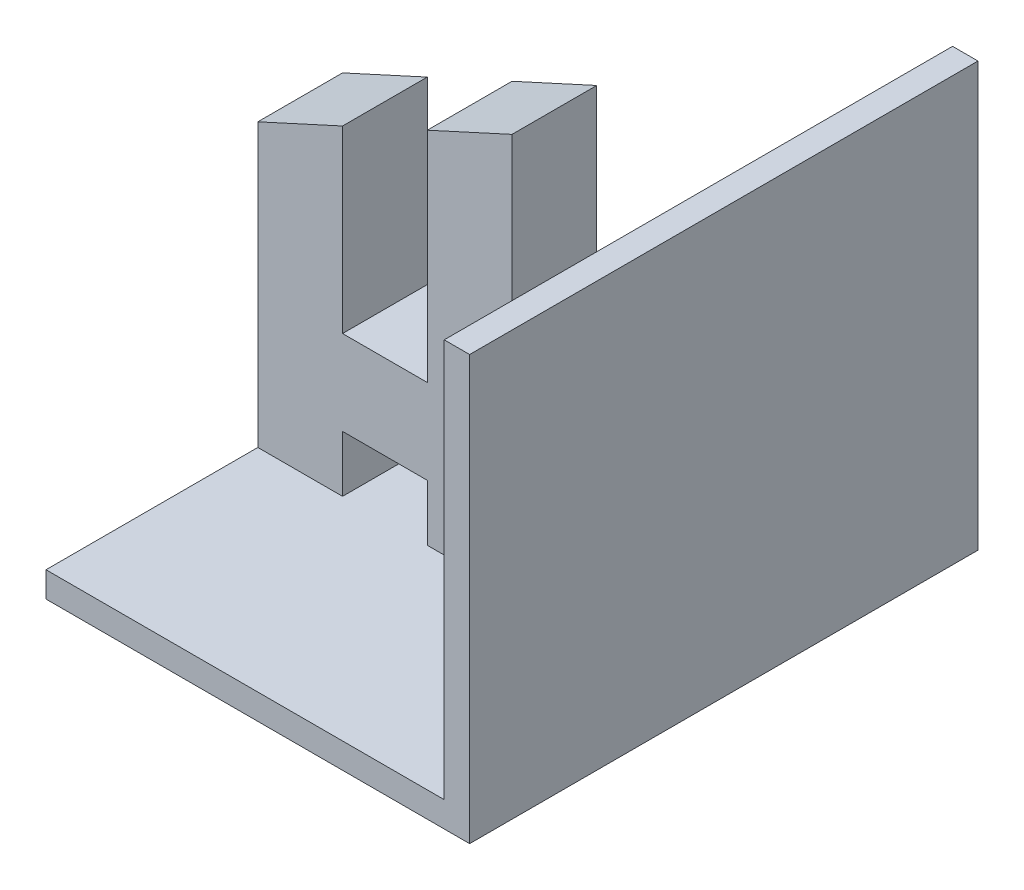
ISO-10303-21;
HEADER;
FILE_DESCRIPTION(('STEP AP214'),'2;1');
FILE_NAME('part.step','',(''),(''),'','','');
FILE_SCHEMA(('AUTOMOTIVE_DESIGN { 1 0 10303 214 1 1 1 1 }'));
ENDSEC;
DATA;
#1=APPLICATION_CONTEXT('core data for automotive mechanical design processes');
#2=APPLICATION_PROTOCOL_DEFINITION('international standard','automotive_design',2000,#1);
#3=PRODUCT_CONTEXT('',#1,'mechanical');
#4=PRODUCT('Part','Part','',(#3));
#5=PRODUCT_RELATED_PRODUCT_CATEGORY('part','',(#4));
#6=PRODUCT_DEFINITION_FORMATION('','',#4);
#7=PRODUCT_DEFINITION_CONTEXT('part definition',#1,'design');
#8=PRODUCT_DEFINITION('design','',#6,#7);
#9=PRODUCT_DEFINITION_SHAPE('','',#8);
#10=(LENGTH_UNIT() NAMED_UNIT(*) SI_UNIT(.MILLI.,.METRE.));
#11=(NAMED_UNIT(*) PLANE_ANGLE_UNIT() SI_UNIT($,.RADIAN.));
#12=(NAMED_UNIT(*) SI_UNIT($,.STERADIAN.) SOLID_ANGLE_UNIT());
#13=UNCERTAINTY_MEASURE_WITH_UNIT(LENGTH_MEASURE(1.E-05),#10,'distance_accuracy_value','');
#14=(GEOMETRIC_REPRESENTATION_CONTEXT(3) GLOBAL_UNCERTAINTY_ASSIGNED_CONTEXT((#13)) GLOBAL_UNIT_ASSIGNED_CONTEXT((#10,
#11,#12)) REPRESENTATION_CONTEXT('',''));
#15=CARTESIAN_POINT('',(0.,0.,0.));
#16=DIRECTION('',(0.,0.,1.));
#17=DIRECTION('',(1.,0.,0.));
#18=AXIS2_PLACEMENT_3D('',#15,#16,#17);
#19=CARTESIAN_POINT('',(-3.,0.,30.));
#20=DIRECTION('',(-1.,0.,0.));
#21=DIRECTION('',(0.,0.,1.));
#22=AXIS2_PLACEMENT_3D('',#19,#20,#21);
#23=PLANE('',#22);
#24=DIRECTION('',(0.,1.,0.));
#25=VECTOR('',#24,1.);
#26=CARTESIAN_POINT('',(-3.,0.,-30.));
#27=LINE('',#26,#25);
#28=CARTESIAN_POINT('',(-3.,3.,-30.));
#29=VERTEX_POINT('',#28);
#30=CARTESIAN_POINT('',(-3.,50.,-30.));
#31=VERTEX_POINT('',#30);
#32=EDGE_CURVE('E314',#29,#31,#27,.T.);
#33=ORIENTED_EDGE('',*,*,#32,.F.);
#34=DIRECTION('',(0.,0.,-1.));
#35=VECTOR('',#34,1.);
#36=CARTESIAN_POINT('',(-3.,3.,30.));
#37=LINE('',#36,#35);
#38=CARTESIAN_POINT('',(-3.,3.,30.));
#39=VERTEX_POINT('',#38);
#40=EDGE_CURVE('E336',#39,#29,#37,.T.);
#41=ORIENTED_EDGE('',*,*,#40,.F.);
#42=DIRECTION('',(0.,1.,0.));
#43=VECTOR('',#42,1.);
#44=CARTESIAN_POINT('',(-3.,0.,30.));
#45=LINE('',#44,#43);
#46=CARTESIAN_POINT('',(-3.,50.,30.));
#47=VERTEX_POINT('',#46);
#48=EDGE_CURVE('E326',#39,#47,#45,.T.);
#49=ORIENTED_EDGE('',*,*,#48,.T.);
#50=DIRECTION('',(0.,0.,-1.));
#51=VECTOR('',#50,1.);
#52=CARTESIAN_POINT('',(-3.,50.,30.));
#53=LINE('',#52,#51);
#54=EDGE_CURVE('E41',#47,#31,#53,.T.);
#55=ORIENTED_EDGE('',*,*,#54,.T.);
#56=EDGE_LOOP('',(#33,#41,#49,#55));
#57=FACE_BOUND('',#56,.T.);
#58=DIRECTION('',(0.,0.,1.));
#59=VECTOR('',#58,1.);
#60=CARTESIAN_POINT('',(-3.,9.64285714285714,-4.9999999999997));
#61=LINE('',#60,#59);
#62=CARTESIAN_POINT('',(-3.,9.64285714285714,-4.9999999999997));
#63=VERTEX_POINT('',#62);
#64=CARTESIAN_POINT('',(-3.,9.64285714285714,4.99999999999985));
#65=VERTEX_POINT('',#64);
#66=EDGE_CURVE('E188',#63,#65,#61,.T.);
#67=ORIENTED_EDGE('',*,*,#66,.F.);
#68=DIRECTION('',(0.,-1.,0.));
#69=VECTOR('',#68,1.);
#70=CARTESIAN_POINT('',(-3.,19.6428571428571,-4.99999999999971));
#71=LINE('',#70,#69);
#72=CARTESIAN_POINT('',(-3.,19.6428571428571,-4.99999999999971));
#73=VERTEX_POINT('',#72);
#74=EDGE_CURVE('E195',#73,#63,#71,.T.);
#75=ORIENTED_EDGE('',*,*,#74,.F.);
#76=DIRECTION('',(0.,0.,-1.));
#77=VECTOR('',#76,1.);
#78=CARTESIAN_POINT('',(-3.,19.6428571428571,-4.99999999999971));
#79=LINE('',#78,#77);
#80=CARTESIAN_POINT('',(-3.,19.6428571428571,4.99999999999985));
#81=VERTEX_POINT('',#80);
#82=EDGE_CURVE('E206',#81,#73,#79,.T.);
#83=ORIENTED_EDGE('',*,*,#82,.F.);
#84=DIRECTION('',(0.,1.,0.));
#85=VECTOR('',#84,1.);
#86=CARTESIAN_POINT('',(-3.,19.6428571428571,4.99999999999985));
#87=LINE('',#86,#85);
#88=EDGE_CURVE('E48',#65,#81,#87,.T.);
#89=ORIENTED_EDGE('',*,*,#88,.F.);
#90=EDGE_LOOP('',(#67,#75,#83,#89));
#91=FACE_BOUND('',#90,.T.);
#92=ADVANCED_FACE('F33',(#57,#91),#23,.T.);
#93=CARTESIAN_POINT('',(-30.0000000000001,50.,-4.99999999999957));
#94=DIRECTION('',(1.,0.,0.));
#95=DIRECTION('',(0.,0.,-1.));
#96=AXIS2_PLACEMENT_3D('',#93,#94,#95);
#97=PLANE('',#96);
#98=DIRECTION('',(0.,0.,1.));
#99=VECTOR('',#98,1.);
#100=CARTESIAN_POINT('',(-30.0000000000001,9.64285714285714,-4.99999999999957));
#101=LINE('',#100,#99);
#102=CARTESIAN_POINT('',(-30.0000000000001,9.64285714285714,-4.99999999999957));
#103=VERTEX_POINT('',#102);
#104=CARTESIAN_POINT('',(-30.,9.64285714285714,4.99999999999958));
#105=VERTEX_POINT('',#104);
#106=EDGE_CURVE('E56',#103,#105,#101,.T.);
#107=ORIENTED_EDGE('',*,*,#106,.F.);
#108=DIRECTION('',(0.,-1.,0.));
#109=VECTOR('',#108,1.);
#110=CARTESIAN_POINT('',(-30.0000000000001,50.,-4.99999999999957));
#111=LINE('',#110,#109);
#112=CARTESIAN_POINT('',(-30.0000000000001,3.,-4.99999999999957));
#113=VERTEX_POINT('',#112);
#114=EDGE_CURVE('E305',#103,#113,#111,.T.);
#115=ORIENTED_EDGE('',*,*,#114,.T.);
#116=DIRECTION('',(0.,0.,1.));
#117=VECTOR('',#116,1.);
#118=CARTESIAN_POINT('',(-30.0000000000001,3.,-4.99999999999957));
#119=LINE('',#118,#117);
#120=CARTESIAN_POINT('',(-30.,3.,4.99999999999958));
#121=VERTEX_POINT('',#120);
#122=EDGE_CURVE('E284',#113,#121,#119,.T.);
#123=ORIENTED_EDGE('',*,*,#122,.T.);
#124=DIRECTION('',(0.,-1.,0.));
#125=VECTOR('',#124,1.);
#126=CARTESIAN_POINT('',(-30.,50.,4.99999999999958));
#127=LINE('',#126,#125);
#128=EDGE_CURVE('E301',#105,#121,#127,.T.);
#129=ORIENTED_EDGE('',*,*,#128,.F.);
#130=EDGE_LOOP('',(#107,#115,#123,#129));
#131=FACE_BOUND('',#130,.T.);
#132=ADVANCED_FACE('F418',(#131),#97,.F.);
#133=DIRECTION('',(0.,0.,-1.));
#134=VECTOR('',#133,1.);
#135=CARTESIAN_POINT('',(-30.0000000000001,19.6428571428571,-4.99999999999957));
#136=LINE('',#135,#134);
#137=CARTESIAN_POINT('',(-30.,19.6428571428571,4.99999999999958));
#138=VERTEX_POINT('',#137);
#139=CARTESIAN_POINT('',(-30.,19.6428571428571,-4.99999999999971));
#140=VERTEX_POINT('',#139);
#141=EDGE_CURVE('E229',#138,#140,#136,.T.);
#142=ORIENTED_EDGE('',*,*,#141,.F.);
#143=CARTESIAN_POINT('',(-30.,45.4285714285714,4.99999999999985));
#144=VERTEX_POINT('',#143);
#145=EDGE_CURVE('E302',#144,#138,#127,.T.);
#146=ORIENTED_EDGE('',*,*,#145,.F.);
#147=DIRECTION('',(0.,0.,1.));
#148=VECTOR('',#147,1.);
#149=CARTESIAN_POINT('',(-30.0000000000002,45.4285714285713,-30.0009999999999));
#150=LINE('',#149,#148);
#151=CARTESIAN_POINT('',(-30.0000000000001,45.4285714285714,-4.99999999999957));
#152=VERTEX_POINT('',#151);
#153=EDGE_CURVE('E246',#152,#144,#150,.T.);
#154=ORIENTED_EDGE('',*,*,#153,.F.);
#155=EDGE_CURVE('E306',#152,#140,#111,.T.);
#156=ORIENTED_EDGE('',*,*,#155,.T.);
#157=EDGE_LOOP('',(#142,#146,#154,#156));
#158=FACE_BOUND('',#157,.T.);
#159=ADVANCED_FACE('F397',(#158),#97,.F.);
#160=CARTESIAN_POINT('',(-20.,50.,4.99999999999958));
#161=DIRECTION('',(-1.,0.,0.));
#162=DIRECTION('',(0.,0.,1.));
#163=AXIS2_PLACEMENT_3D('',#160,#161,#162);
#164=PLANE('',#163);
#165=DIRECTION('',(0.,0.,-1.));
#166=VECTOR('',#165,1.);
#167=CARTESIAN_POINT('',(-20.,9.64285714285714,4.99999999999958));
#168=LINE('',#167,#166);
#169=CARTESIAN_POINT('',(-20.,9.64285714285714,4.99999999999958));
#170=VERTEX_POINT('',#169);
#171=CARTESIAN_POINT('',(-20.0000000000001,9.64285714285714,-4.99999999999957));
#172=VERTEX_POINT('',#171);
#173=EDGE_CURVE('E189',#170,#172,#168,.T.);
#174=ORIENTED_EDGE('',*,*,#173,.F.);
#175=DIRECTION('',(0.,-1.,0.));
#176=VECTOR('',#175,1.);
#177=CARTESIAN_POINT('',(-20.,50.,4.99999999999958));
#178=LINE('',#177,#176);
#179=CARTESIAN_POINT('',(-20.,3.,4.99999999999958));
#180=VERTEX_POINT('',#179);
#181=EDGE_CURVE('E298',#170,#180,#178,.T.);
#182=ORIENTED_EDGE('',*,*,#181,.T.);
#183=DIRECTION('',(0.,0.,-1.));
#184=VECTOR('',#183,1.);
#185=CARTESIAN_POINT('',(-20.,3.,4.99999999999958));
#186=LINE('',#185,#184);
#187=CARTESIAN_POINT('',(-20.0000000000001,3.,-4.99999999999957));
#188=VERTEX_POINT('',#187);
#189=EDGE_CURVE('E290',#180,#188,#186,.T.);
#190=ORIENTED_EDGE('',*,*,#189,.T.);
#191=DIRECTION('',(0.,-1.,0.));
#192=VECTOR('',#191,1.);
#193=CARTESIAN_POINT('',(-20.0000000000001,50.,-4.99999999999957));
#194=LINE('',#193,#192);
#195=EDGE_CURVE('E295',#172,#188,#194,.T.);
#196=ORIENTED_EDGE('',*,*,#195,.F.);
#197=EDGE_LOOP('',(#174,#182,#190,#196));
#198=FACE_BOUND('',#197,.T.);
#199=ADVANCED_FACE('F444',(#198),#164,.F.);
#200=DIRECTION('',(0.,0.,1.));
#201=VECTOR('',#200,1.);
#202=CARTESIAN_POINT('',(-20.,19.6428571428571,4.99999999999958));
#203=LINE('',#202,#201);
#204=CARTESIAN_POINT('',(-20.0000000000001,19.6428571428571,-4.99999999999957));
#205=VERTEX_POINT('',#204);
#206=CARTESIAN_POINT('',(-20.,19.6428571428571,4.99999999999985));
#207=VERTEX_POINT('',#206);
#208=EDGE_CURVE('E226',#205,#207,#203,.T.);
#209=ORIENTED_EDGE('',*,*,#208,.F.);
#210=CARTESIAN_POINT('',(-20.0000000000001,50.,-4.99999999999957));
#211=VERTEX_POINT('',#210);
#212=EDGE_CURVE('E296',#211,#205,#194,.T.);
#213=ORIENTED_EDGE('',*,*,#212,.F.);
#214=DIRECTION('',(0.,0.,-1.));
#215=VECTOR('',#214,1.);
#216=CARTESIAN_POINT('',(-20.,50.,4.99999999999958));
#217=LINE('',#216,#215);
#218=CARTESIAN_POINT('',(-20.,50.,4.99999999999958));
#219=VERTEX_POINT('',#218);
#220=EDGE_CURVE('E293',#219,#211,#217,.T.);
#221=ORIENTED_EDGE('',*,*,#220,.F.);
#222=EDGE_CURVE('E299',#219,#207,#178,.T.);
#223=ORIENTED_EDGE('',*,*,#222,.T.);
#224=EDGE_LOOP('',(#209,#213,#221,#223));
#225=FACE_BOUND('',#224,.T.);
#226=ADVANCED_FACE('F406',(#225),#164,.F.);
#227=CARTESIAN_POINT('',(-40.,50.,4.99999999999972));
#228=DIRECTION('',(-1.,0.,0.));
#229=DIRECTION('',(0.,0.,1.));
#230=AXIS2_PLACEMENT_3D('',#227,#228,#229);
#231=PLANE('',#230);
#232=DIRECTION('',(0.,0.,1.));
#233=VECTOR('',#232,1.);
#234=CARTESIAN_POINT('',(-40.,9.64285714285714,-4.9999999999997));
#235=LINE('',#234,#233);
#236=CARTESIAN_POINT('',(-40.,9.64285714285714,-4.99999999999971));
#237=VERTEX_POINT('',#236);
#238=CARTESIAN_POINT('',(-40.,9.64285714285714,4.99999999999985));
#239=VERTEX_POINT('',#238);
#240=EDGE_CURVE('E210',#237,#239,#235,.T.);
#241=ORIENTED_EDGE('',*,*,#240,.T.);
#242=DIRECTION('',(0.,-1.,0.));
#243=VECTOR('',#242,1.);
#244=CARTESIAN_POINT('',(-40.,50.,4.99999999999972));
#245=LINE('',#244,#243);
#246=CARTESIAN_POINT('',(-40.,3.,4.99999999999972));
#247=VERTEX_POINT('',#246);
#248=EDGE_CURVE('E277',#239,#247,#245,.T.);
#249=ORIENTED_EDGE('',*,*,#248,.T.);
#250=DIRECTION('',(0.,0.,-1.));
#251=VECTOR('',#250,1.);
#252=CARTESIAN_POINT('',(-40.,3.,4.99999999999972));
#253=LINE('',#252,#251);
#254=CARTESIAN_POINT('',(-40.,3.,-4.99999999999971));
#255=VERTEX_POINT('',#254);
#256=EDGE_CURVE('E261',#247,#255,#253,.T.);
#257=ORIENTED_EDGE('',*,*,#256,.T.);
#258=DIRECTION('',(0.,-1.,0.));
#259=VECTOR('',#258,1.);
#260=CARTESIAN_POINT('',(-40.,50.,-4.99999999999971));
#261=LINE('',#260,#259);
#262=EDGE_CURVE('E273',#237,#255,#261,.T.);
#263=ORIENTED_EDGE('',*,*,#262,.F.);
#264=EDGE_LOOP('',(#241,#249,#257,#263));
#265=FACE_BOUND('',#264,.T.);
#266=ADVANCED_FACE('F379',(#265),#231,.F.);
#267=DIRECTION('',(0.,0.,-1.));
#268=VECTOR('',#267,1.);
#269=CARTESIAN_POINT('',(-40.,19.6428571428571,-4.99999999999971));
#270=LINE('',#269,#268);
#271=CARTESIAN_POINT('',(-40.,19.6428571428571,4.99999999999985));
#272=VERTEX_POINT('',#271);
#273=CARTESIAN_POINT('',(-40.,19.6428571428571,-4.99999999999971));
#274=VERTEX_POINT('',#273);
#275=EDGE_CURVE('E213',#272,#274,#270,.T.);
#276=ORIENTED_EDGE('',*,*,#275,.T.);
#277=CARTESIAN_POINT('',(-40.,40.8571428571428,-4.9999999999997));
#278=VERTEX_POINT('',#277);
#279=EDGE_CURVE('E274',#278,#274,#261,.T.);
#280=ORIENTED_EDGE('',*,*,#279,.F.);
#281=DIRECTION('',(0.,0.,-1.));
#282=VECTOR('',#281,1.);
#283=CARTESIAN_POINT('',(-40.0000000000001,40.8571428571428,-30.0009999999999));
#284=LINE('',#283,#282);
#285=CARTESIAN_POINT('',(-40.,40.8571428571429,4.99999999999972));
#286=VERTEX_POINT('',#285);
#287=EDGE_CURVE('E247',#286,#278,#284,.T.);
#288=ORIENTED_EDGE('',*,*,#287,.F.);
#289=EDGE_CURVE('E278',#286,#272,#245,.T.);
#290=ORIENTED_EDGE('',*,*,#289,.T.);
#291=EDGE_LOOP('',(#276,#280,#288,#290));
#292=FACE_BOUND('',#291,.T.);
#293=ADVANCED_FACE('F389',(#292),#231,.F.);
#294=CARTESIAN_POINT('',(0.,3.,30.));
#295=DIRECTION('',(0.,1.,0.));
#296=DIRECTION('',(-1.,0.,0.));
#297=AXIS2_PLACEMENT_3D('',#294,#295,#296);
#298=PLANE('',#297);
#299=DIRECTION('',(0.,0.,-1.));
#300=VECTOR('',#299,1.);
#301=CARTESIAN_POINT('',(-50.,2.99999999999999,30.));
#302=LINE('',#301,#300);
#303=CARTESIAN_POINT('',(-50.,3.,30.));
#304=VERTEX_POINT('',#303);
#305=CARTESIAN_POINT('',(-50.,3.,4.99999999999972));
#306=VERTEX_POINT('',#305);
#307=EDGE_CURVE('E243',#304,#306,#302,.T.);
#308=ORIENTED_EDGE('',*,*,#307,.F.);
#309=DIRECTION('',(1.,0.,0.));
#310=VECTOR('',#309,1.);
#311=CARTESIAN_POINT('',(0.,3.,30.));
#312=LINE('',#311,#310);
#313=EDGE_CURVE('E329',#304,#39,#312,.T.);
#314=ORIENTED_EDGE('',*,*,#313,.T.);
#315=ORIENTED_EDGE('',*,*,#40,.T.);
#316=DIRECTION('',(1.,0.,0.));
#317=VECTOR('',#316,1.);
#318=CARTESIAN_POINT('',(0.,3.,-30.));
#319=LINE('',#318,#317);
#320=CARTESIAN_POINT('',(-50.,2.99999999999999,-30.));
#321=VERTEX_POINT('',#320);
#322=EDGE_CURVE('E317',#321,#29,#319,.T.);
#323=ORIENTED_EDGE('',*,*,#322,.F.);
#324=CARTESIAN_POINT('',(-50.,3.,-4.99999999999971));
#325=VERTEX_POINT('',#324);
#326=EDGE_CURVE('E241',#325,#321,#302,.T.);
#327=ORIENTED_EDGE('',*,*,#326,.F.);
#328=DIRECTION('',(-1.,0.,0.));
#329=VECTOR('',#328,1.);
#330=CARTESIAN_POINT('',(-50.,2.99999999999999,-4.99999999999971));
#331=LINE('',#330,#329);
#332=EDGE_CURVE('E264',#255,#325,#331,.T.);
#333=ORIENTED_EDGE('',*,*,#332,.F.);
#334=ORIENTED_EDGE('',*,*,#256,.F.);
#335=DIRECTION('',(1.,0.,0.));
#336=VECTOR('',#335,1.);
#337=CARTESIAN_POINT('',(-50.,2.99999999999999,4.99999999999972));
#338=LINE('',#337,#336);
#339=EDGE_CURVE('E258',#306,#247,#338,.T.);
#340=ORIENTED_EDGE('',*,*,#339,.F.);
#341=EDGE_LOOP('',(#308,#314,#315,#323,#327,#333,#334,#340));
#342=FACE_BOUND('',#341,.T.);
#343=ORIENTED_EDGE('',*,*,#122,.F.);
#344=DIRECTION('',(-1.,0.,0.));
#345=VECTOR('',#344,1.);
#346=CARTESIAN_POINT('',(-30.0000000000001,3.,-4.99999999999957));
#347=LINE('',#346,#345);
#348=EDGE_CURVE('E281',#188,#113,#347,.T.);
#349=ORIENTED_EDGE('',*,*,#348,.F.);
#350=ORIENTED_EDGE('',*,*,#189,.F.);
#351=DIRECTION('',(1.,0.,0.));
#352=VECTOR('',#351,1.);
#353=CARTESIAN_POINT('',(-30.,3.,4.99999999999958));
#354=LINE('',#353,#352);
#355=EDGE_CURVE('E287',#121,#180,#354,.T.);
#356=ORIENTED_EDGE('',*,*,#355,.F.);
#357=EDGE_LOOP('',(#343,#349,#350,#356));
#358=FACE_BOUND('',#357,.T.);
#359=ADVANCED_FACE('F354',(#342,#358),#298,.T.);
#360=CARTESIAN_POINT('',(0.,0.,30.));
#361=DIRECTION('',(-1.,0.,0.));
#362=DIRECTION('',(0.,0.,1.));
#363=AXIS2_PLACEMENT_3D('',#360,#361,#362);
#364=PLANE('',#363);
#365=DIRECTION('',(0.,1.,0.));
#366=VECTOR('',#365,1.);
#367=CARTESIAN_POINT('',(0.,0.,-30.));
#368=LINE('',#367,#366);
#369=CARTESIAN_POINT('',(0.,0.,-30.));
#370=VERTEX_POINT('',#369);
#371=CARTESIAN_POINT('',(0.,50.,-30.));
#372=VERTEX_POINT('',#371);
#373=EDGE_CURVE('E308',#370,#372,#368,.T.);
#374=ORIENTED_EDGE('',*,*,#373,.T.);
#375=DIRECTION('',(0.,0.,-1.));
#376=VECTOR('',#375,1.);
#377=CARTESIAN_POINT('',(0.,50.,30.));
#378=LINE('',#377,#376);
#379=CARTESIAN_POINT('',(0.,50.,30.));
#380=VERTEX_POINT('',#379);
#381=EDGE_CURVE('E11',#380,#372,#378,.T.);
#382=ORIENTED_EDGE('',*,*,#381,.F.);
#383=DIRECTION('',(0.,1.,0.));
#384=VECTOR('',#383,1.);
#385=CARTESIAN_POINT('',(0.,0.,30.));
#386=LINE('',#385,#384);
#387=CARTESIAN_POINT('',(0.,0.,30.));
#388=VERTEX_POINT('',#387);
#389=EDGE_CURVE('E321',#388,#380,#386,.T.);
#390=ORIENTED_EDGE('',*,*,#389,.F.);
#391=DIRECTION('',(0.,0.,-1.));
#392=VECTOR('',#391,1.);
#393=CARTESIAN_POINT('',(0.,0.,30.));
#394=LINE('',#393,#392);
#395=EDGE_CURVE('E333',#388,#370,#394,.T.);
#396=ORIENTED_EDGE('',*,*,#395,.T.);
#397=EDGE_LOOP('',(#374,#382,#390,#396));
#398=FACE_BOUND('',#397,.T.);
#399=ADVANCED_FACE('F35',(#398),#364,.F.);
#400=CARTESIAN_POINT('',(-3.,50.,30.));
#401=DIRECTION('',(0.,1.,0.));
#402=DIRECTION('',(0.,0.,1.));
#403=AXIS2_PLACEMENT_3D('',#400,#401,#402);
#404=PLANE('',#403);
#405=DIRECTION('',(1.,0.,0.));
#406=VECTOR('',#405,1.);
#407=CARTESIAN_POINT('',(-3.,50.,-30.));
#408=LINE('',#407,#406);
#409=EDGE_CURVE('E311',#31,#372,#408,.T.);
#410=ORIENTED_EDGE('',*,*,#409,.F.);
#411=ORIENTED_EDGE('',*,*,#54,.F.);
#412=DIRECTION('',(1.,0.,0.));
#413=VECTOR('',#412,1.);
#414=CARTESIAN_POINT('',(-3.,50.,30.));
#415=LINE('',#414,#413);
#416=EDGE_CURVE('E323',#47,#380,#415,.T.);
#417=ORIENTED_EDGE('',*,*,#416,.T.);
#418=ORIENTED_EDGE('',*,*,#381,.T.);
#419=EDGE_LOOP('',(#410,#411,#417,#418));
#420=FACE_BOUND('',#419,.T.);
#421=ADVANCED_FACE('F345',(#420),#404,.T.);
#422=CARTESIAN_POINT('',(0.,0.,30.));
#423=DIRECTION('',(0.,1.,0.));
#424=DIRECTION('',(-1.,0.,0.));
#425=AXIS2_PLACEMENT_3D('',#422,#423,#424);
#426=PLANE('',#425);
#427=DIRECTION('',(1.,0.,0.));
#428=VECTOR('',#427,1.);
#429=CARTESIAN_POINT('',(0.,0.,30.));
#430=LINE('',#429,#428);
#431=CARTESIAN_POINT('',(-50.,0.,30.));
#432=VERTEX_POINT('',#431);
#433=EDGE_CURVE('E331',#432,#388,#430,.T.);
#434=ORIENTED_EDGE('',*,*,#433,.F.);
#435=DIRECTION('',(0.,0.,1.));
#436=VECTOR('',#435,1.);
#437=CARTESIAN_POINT('',(-50.,0.,-30.));
#438=LINE('',#437,#436);
#439=CARTESIAN_POINT('',(-50.,0.,-30.));
#440=VERTEX_POINT('',#439);
#441=EDGE_CURVE('E239',#440,#432,#438,.T.);
#442=ORIENTED_EDGE('',*,*,#441,.F.);
#443=DIRECTION('',(1.,0.,0.));
#444=VECTOR('',#443,1.);
#445=CARTESIAN_POINT('',(0.,0.,-30.));
#446=LINE('',#445,#444);
#447=EDGE_CURVE('E319',#440,#370,#446,.T.);
#448=ORIENTED_EDGE('',*,*,#447,.T.);
#449=ORIENTED_EDGE('',*,*,#395,.F.);
#450=EDGE_LOOP('',(#434,#442,#448,#449));
#451=FACE_BOUND('',#450,.T.);
#452=ADVANCED_FACE('F366',(#451),#426,.F.);
#453=CARTESIAN_POINT('',(0.,50.,30.));
#454=DIRECTION('',(0.,0.,-1.));
#455=DIRECTION('',(-1.,0.,0.));
#456=AXIS2_PLACEMENT_3D('',#453,#454,#455);
#457=PLANE('',#456);
#458=ORIENTED_EDGE('',*,*,#313,.F.);
#459=DIRECTION('',(0.,1.,0.));
#460=VECTOR('',#459,1.);
#461=CARTESIAN_POINT('',(-50.,0.,30.));
#462=LINE('',#461,#460);
#463=EDGE_CURVE('E234',#432,#304,#462,.T.);
#464=ORIENTED_EDGE('',*,*,#463,.F.);
#465=ORIENTED_EDGE('',*,*,#433,.T.);
#466=ORIENTED_EDGE('',*,*,#389,.T.);
#467=ORIENTED_EDGE('',*,*,#416,.F.);
#468=ORIENTED_EDGE('',*,*,#48,.F.);
#469=EDGE_LOOP('',(#458,#464,#465,#466,#467,#468));
#470=FACE_BOUND('',#469,.T.);
#471=ADVANCED_FACE('F358',(#470),#457,.F.);
#472=CARTESIAN_POINT('',(0.,50.,-30.));
#473=DIRECTION('',(0.,0.,-1.));
#474=DIRECTION('',(-1.,0.,0.));
#475=AXIS2_PLACEMENT_3D('',#472,#473,#474);
#476=PLANE('',#475);
#477=DIRECTION('',(0.,1.,0.));
#478=VECTOR('',#477,1.);
#479=CARTESIAN_POINT('',(-50.,0.,-30.));
#480=LINE('',#479,#478);
#481=EDGE_CURVE('E236',#440,#321,#480,.T.);
#482=ORIENTED_EDGE('',*,*,#481,.T.);
#483=ORIENTED_EDGE('',*,*,#322,.T.);
#484=ORIENTED_EDGE('',*,*,#32,.T.);
#485=ORIENTED_EDGE('',*,*,#409,.T.);
#486=ORIENTED_EDGE('',*,*,#373,.F.);
#487=ORIENTED_EDGE('',*,*,#447,.F.);
#488=EDGE_LOOP('',(#482,#483,#484,#485,#486,#487));
#489=FACE_BOUND('',#488,.T.);
#490=ADVANCED_FACE('F349',(#489),#476,.T.);
#491=CARTESIAN_POINT('',(-30.0000000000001,50.,-4.99999999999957));
#492=DIRECTION('',(0.,0.,1.));
#493=DIRECTION('',(1.,0.,0.));
#494=AXIS2_PLACEMENT_3D('',#491,#492,#493);
#495=PLANE('',#494);
#496=DIRECTION('',(1.,0.,0.));
#497=VECTOR('',#496,1.);
#498=CARTESIAN_POINT('',(-40.,19.6428571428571,-4.99999999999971));
#499=LINE('',#498,#497);
#500=EDGE_CURVE('E216',#274,#140,#499,.T.);
#501=ORIENTED_EDGE('',*,*,#500,.T.);
#502=ORIENTED_EDGE('',*,*,#155,.F.);
#503=DIRECTION('',(-0.9094744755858,-0.415759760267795,0.));
#504=VECTOR('',#503,1.);
#505=CARTESIAN_POINT('',(-20.,50.,-4.99999999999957));
#506=LINE('',#505,#504);
#507=EDGE_CURVE('E256',#211,#152,#506,.T.);
#508=ORIENTED_EDGE('',*,*,#507,.F.);
#509=ORIENTED_EDGE('',*,*,#212,.T.);
#510=EDGE_CURVE('E200',#205,#73,#499,.T.);
#511=ORIENTED_EDGE('',*,*,#510,.T.);
#512=ORIENTED_EDGE('',*,*,#74,.T.);
#513=DIRECTION('',(1.,0.,0.));
#514=VECTOR('',#513,1.);
#515=CARTESIAN_POINT('',(-40.,9.64285714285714,-4.9999999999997));
#516=LINE('',#515,#514);
#517=EDGE_CURVE('E183',#172,#63,#516,.T.);
#518=ORIENTED_EDGE('',*,*,#517,.F.);
#519=ORIENTED_EDGE('',*,*,#195,.T.);
#520=ORIENTED_EDGE('',*,*,#348,.T.);
#521=ORIENTED_EDGE('',*,*,#114,.F.);
#522=EDGE_CURVE('E191',#237,#103,#516,.T.);
#523=ORIENTED_EDGE('',*,*,#522,.F.);
#524=ORIENTED_EDGE('',*,*,#262,.T.);
#525=ORIENTED_EDGE('',*,*,#332,.T.);
#526=DIRECTION('',(0.,-1.,0.));
#527=VECTOR('',#526,1.);
#528=CARTESIAN_POINT('',(-50.,50.,-4.99999999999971));
#529=LINE('',#528,#527);
#530=CARTESIAN_POINT('',(-50.,36.2857142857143,-4.99999999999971));
#531=VERTEX_POINT('',#530);
#532=EDGE_CURVE('E270',#531,#325,#529,.T.);
#533=ORIENTED_EDGE('',*,*,#532,.F.);
#534=DIRECTION('',(-0.9094744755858,-0.415759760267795,0.));
#535=VECTOR('',#534,1.);
#536=CARTESIAN_POINT('',(-20.,50.,-4.9999999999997));
#537=LINE('',#536,#535);
#538=EDGE_CURVE('E244',#278,#531,#537,.T.);
#539=ORIENTED_EDGE('',*,*,#538,.F.);
#540=ORIENTED_EDGE('',*,*,#279,.T.);
#541=EDGE_LOOP('',(#501,#502,#508,#509,#511,#512,#518,#519,#520,#521,#523,#524,#525,#533,#539,#540));
#542=FACE_BOUND('',#541,.T.);
#543=ADVANCED_FACE('F197',(#542),#495,.F.);
#544=CARTESIAN_POINT('',(-30.,50.,4.99999999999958));
#545=DIRECTION('',(0.,0.,-1.));
#546=DIRECTION('',(-1.,0.,0.));
#547=AXIS2_PLACEMENT_3D('',#544,#545,#546);
#548=PLANE('',#547);
#549=ORIENTED_EDGE('',*,*,#145,.T.);
#550=DIRECTION('',(1.,0.,0.));
#551=VECTOR('',#550,1.);
#552=CARTESIAN_POINT('',(-40.,19.6428571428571,4.99999999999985));
#553=LINE('',#552,#551);
#554=EDGE_CURVE('E219',#272,#138,#553,.T.);
#555=ORIENTED_EDGE('',*,*,#554,.F.);
#556=ORIENTED_EDGE('',*,*,#289,.F.);
#557=DIRECTION('',(0.9094744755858,0.415759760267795,0.));
#558=VECTOR('',#557,1.);
#559=CARTESIAN_POINT('',(-20.,50.,4.99999999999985));
#560=LINE('',#559,#558);
#561=CARTESIAN_POINT('',(-50.,36.2857142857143,4.99999999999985));
#562=VERTEX_POINT('',#561);
#563=EDGE_CURVE('E251',#562,#286,#560,.T.);
#564=ORIENTED_EDGE('',*,*,#563,.F.);
#565=DIRECTION('',(0.,-1.,0.));
#566=VECTOR('',#565,1.);
#567=CARTESIAN_POINT('',(-50.,50.,4.99999999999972));
#568=LINE('',#567,#566);
#569=EDGE_CURVE('E267',#562,#306,#568,.T.);
#570=ORIENTED_EDGE('',*,*,#569,.T.);
#571=ORIENTED_EDGE('',*,*,#339,.T.);
#572=ORIENTED_EDGE('',*,*,#248,.F.);
#573=DIRECTION('',(1.,0.,0.));
#574=VECTOR('',#573,1.);
#575=CARTESIAN_POINT('',(-40.,9.64285714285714,4.99999999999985));
#576=LINE('',#575,#574);
#577=EDGE_CURVE('E192',#239,#105,#576,.T.);
#578=ORIENTED_EDGE('',*,*,#577,.T.);
#579=ORIENTED_EDGE('',*,*,#128,.T.);
#580=ORIENTED_EDGE('',*,*,#355,.T.);
#581=ORIENTED_EDGE('',*,*,#181,.F.);
#582=EDGE_CURVE('E222',#170,#65,#576,.T.);
#583=ORIENTED_EDGE('',*,*,#582,.T.);
#584=ORIENTED_EDGE('',*,*,#88,.T.);
#585=EDGE_CURVE('E218',#207,#81,#553,.T.);
#586=ORIENTED_EDGE('',*,*,#585,.F.);
#587=ORIENTED_EDGE('',*,*,#222,.F.);
#588=DIRECTION('',(0.9094744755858,0.415759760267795,0.));
#589=VECTOR('',#588,1.);
#590=CARTESIAN_POINT('',(-20.,50.,4.99999999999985));
#591=LINE('',#590,#589);
#592=EDGE_CURVE('E254',#144,#219,#591,.T.);
#593=ORIENTED_EDGE('',*,*,#592,.F.);
#594=EDGE_LOOP('',(#549,#555,#556,#564,#570,#571,#572,#578,#579,#580,#581,#583,#584,#586,#587,#593));
#595=FACE_BOUND('',#594,.T.);
#596=ADVANCED_FACE('F381',(#595),#548,.F.);
#597=CARTESIAN_POINT('',(-50.,50.,-4.99999999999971));
#598=DIRECTION('',(1.,0.,0.));
#599=DIRECTION('',(0.,0.,-1.));
#600=AXIS2_PLACEMENT_3D('',#597,#598,#599);
#601=PLANE('',#600);
#602=ORIENTED_EDGE('',*,*,#569,.F.);
#603=DIRECTION('',(0.,0.,1.));
#604=VECTOR('',#603,1.);
#605=CARTESIAN_POINT('',(-50.0000000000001,36.2857142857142,-30.0009999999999));
#606=LINE('',#605,#604);
#607=EDGE_CURVE('E249',#531,#562,#606,.T.);
#608=ORIENTED_EDGE('',*,*,#607,.F.);
#609=ORIENTED_EDGE('',*,*,#532,.T.);
#610=ORIENTED_EDGE('',*,*,#326,.T.);
#611=ORIENTED_EDGE('',*,*,#481,.F.);
#612=ORIENTED_EDGE('',*,*,#441,.T.);
#613=ORIENTED_EDGE('',*,*,#463,.T.);
#614=ORIENTED_EDGE('',*,*,#307,.T.);
#615=EDGE_LOOP('',(#602,#608,#609,#610,#611,#612,#613,#614));
#616=FACE_BOUND('',#615,.T.);
#617=ADVANCED_FACE('F369',(#616),#601,.F.);
#618=CARTESIAN_POINT('',(-20.,50.,-30.001));
#619=DIRECTION('',(0.415759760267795,-0.9094744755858,0.));
#620=DIRECTION('',(0.9094744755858,0.415759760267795,0.));
#621=AXIS2_PLACEMENT_3D('',#618,#619,#620);
#622=PLANE('',#621);
#623=ORIENTED_EDGE('',*,*,#507,.T.);
#624=ORIENTED_EDGE('',*,*,#153,.T.);
#625=ORIENTED_EDGE('',*,*,#592,.T.);
#626=ORIENTED_EDGE('',*,*,#220,.T.);
#627=EDGE_LOOP('',(#623,#624,#625,#626));
#628=FACE_BOUND('',#627,.T.);
#629=ADVANCED_FACE('F403',(#628),#622,.F.);
#630=CARTESIAN_POINT('',(-20.,50.,-30.001));
#631=DIRECTION('',(0.415759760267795,-0.9094744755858,0.));
#632=DIRECTION('',(0.9094744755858,0.415759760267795,0.));
#633=AXIS2_PLACEMENT_3D('',#630,#631,#632);
#634=PLANE('',#633);
#635=ORIENTED_EDGE('',*,*,#287,.T.);
#636=ORIENTED_EDGE('',*,*,#538,.T.);
#637=ORIENTED_EDGE('',*,*,#607,.T.);
#638=ORIENTED_EDGE('',*,*,#563,.T.);
#639=EDGE_LOOP('',(#635,#636,#637,#638));
#640=FACE_BOUND('',#639,.T.);
#641=ADVANCED_FACE('F384',(#640),#634,.F.);
#642=CARTESIAN_POINT('',(-40.,19.6428571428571,-4.99999999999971));
#643=DIRECTION('',(0.,-1.,0.));
#644=DIRECTION('',(0.,0.,-1.));
#645=AXIS2_PLACEMENT_3D('',#642,#643,#644);
#646=PLANE('',#645);
#647=ORIENTED_EDGE('',*,*,#554,.T.);
#648=ORIENTED_EDGE('',*,*,#141,.T.);
#649=ORIENTED_EDGE('',*,*,#500,.F.);
#650=ORIENTED_EDGE('',*,*,#275,.F.);
#651=EDGE_LOOP('',(#647,#648,#649,#650));
#652=FACE_BOUND('',#651,.T.);
#653=ADVANCED_FACE('F394',(#652),#646,.F.);
#654=CARTESIAN_POINT('',(-40.,9.64285714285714,-4.9999999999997));
#655=DIRECTION('',(0.,1.,0.));
#656=DIRECTION('',(0.,0.,1.));
#657=AXIS2_PLACEMENT_3D('',#654,#655,#656);
#658=PLANE('',#657);
#659=ORIENTED_EDGE('',*,*,#522,.T.);
#660=ORIENTED_EDGE('',*,*,#106,.T.);
#661=ORIENTED_EDGE('',*,*,#577,.F.);
#662=ORIENTED_EDGE('',*,*,#240,.F.);
#663=EDGE_LOOP('',(#659,#660,#661,#662));
#664=FACE_BOUND('',#663,.T.);
#665=ADVANCED_FACE('F414',(#664),#658,.F.);
#666=ORIENTED_EDGE('',*,*,#582,.F.);
#667=ORIENTED_EDGE('',*,*,#173,.T.);
#668=ORIENTED_EDGE('',*,*,#517,.T.);
#669=ORIENTED_EDGE('',*,*,#66,.T.);
#670=EDGE_LOOP('',(#666,#667,#668,#669));
#671=FACE_BOUND('',#670,.T.);
#672=ADVANCED_FACE('F186',(#671),#658,.F.);
#673=ORIENTED_EDGE('',*,*,#510,.F.);
#674=ORIENTED_EDGE('',*,*,#208,.T.);
#675=ORIENTED_EDGE('',*,*,#585,.T.);
#676=ORIENTED_EDGE('',*,*,#82,.T.);
#677=EDGE_LOOP('',(#673,#674,#675,#676));
#678=FACE_BOUND('',#677,.T.);
#679=ADVANCED_FACE('F408',(#678),#646,.F.);
#680=CLOSED_SHELL('',(#92,#132,#159,#199,#226,#266,#293,#359,#399,#421,#452,#471,#490,#543,#596,
#617,#629,#641,#653,#665,#672,#679));
#681=MANIFOLD_SOLID_BREP('B2',#680);
#682=ADVANCED_BREP_SHAPE_REPRESENTATION('',(#18,#681),#14);
#683=SHAPE_DEFINITION_REPRESENTATION(#9,#682);
ENDSEC;
END-ISO-10303-21;
